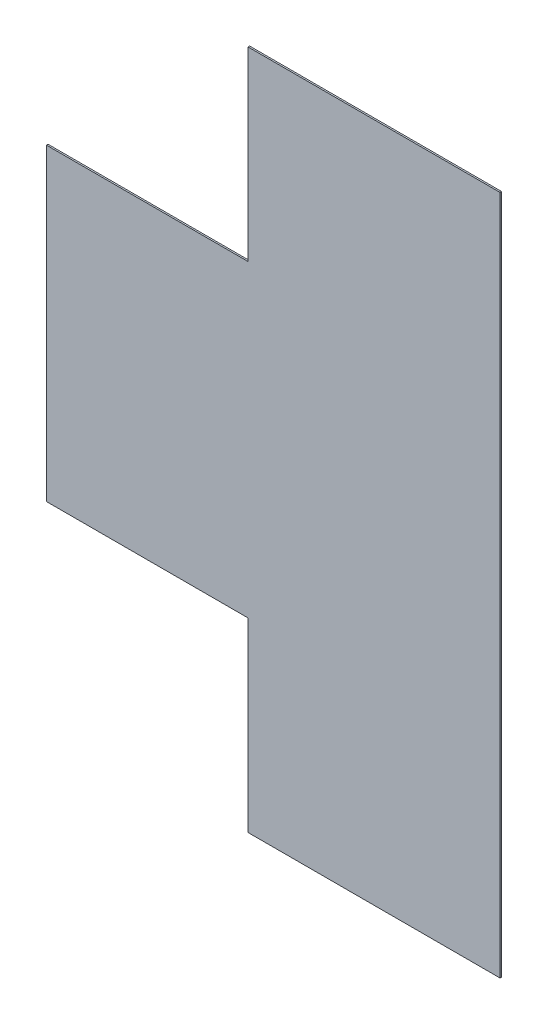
from build123d import *

# Parameters (mm, degrees)
BOSS_EXTRUDE1_DEPTH = 1.5875


with BuildPart() as part:
    # Sketch1 → Boss-Extrude1 (new body)
    with BuildSketch(Plane.XY):
        Polygon((279.786998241, -307.771038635), (25.786998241, -307.771038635), (25.786998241, -495.096038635), (-177.413001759, -495.096038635), (-177.413001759, -806.246038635), (25.786998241, -806.246038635), (25.786998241, -993.571038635), (279.786998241, -993.571038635), align=None)
    extrude(amount=BOSS_EXTRUDE1_DEPTH)


solid = part.part
